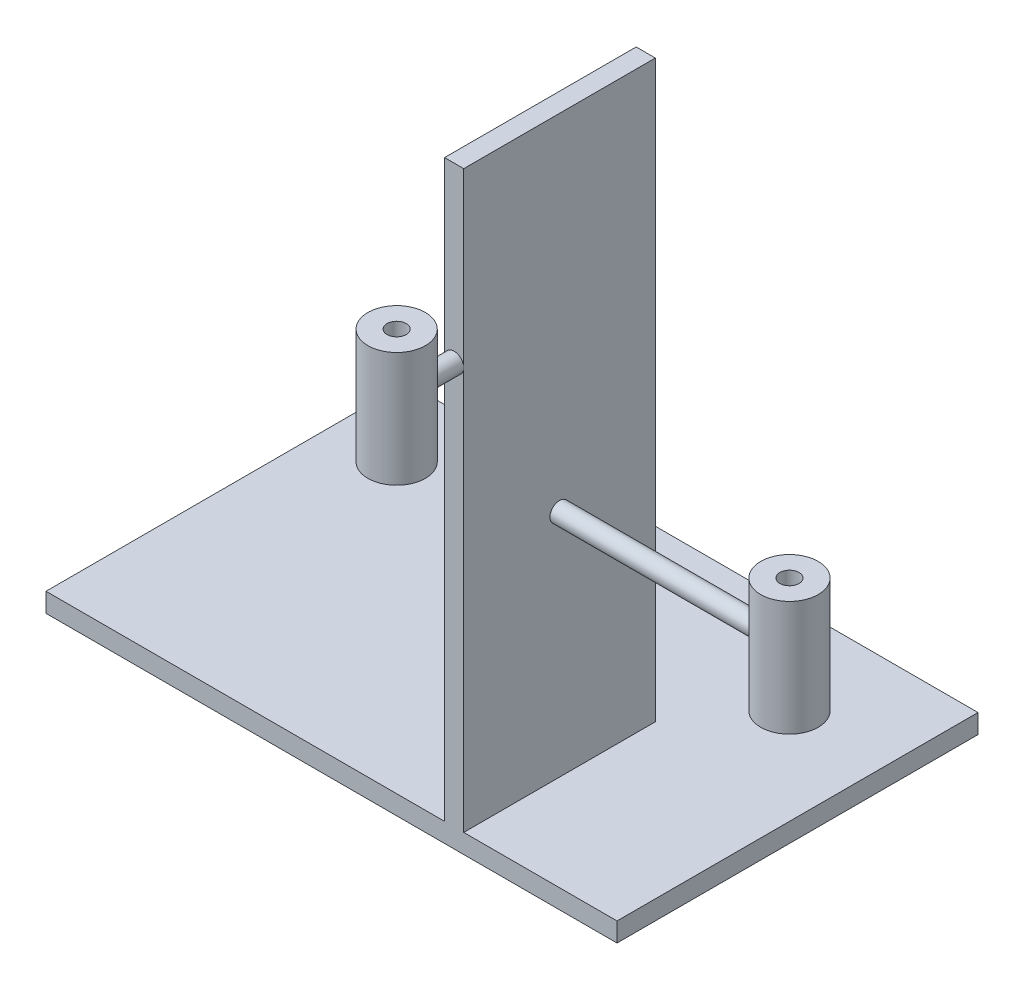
ISO-10303-21;
HEADER;
FILE_DESCRIPTION(('STEP AP214'),'2;1');
FILE_NAME('part.step','',(''),(''),'','','');
FILE_SCHEMA(('AUTOMOTIVE_DESIGN { 1 0 10303 214 1 1 1 1 }'));
ENDSEC;
DATA;
#1=APPLICATION_CONTEXT('core data for automotive mechanical design processes');
#2=APPLICATION_PROTOCOL_DEFINITION('international standard','automotive_design',2000,#1);
#3=PRODUCT_CONTEXT('',#1,'mechanical');
#4=PRODUCT('Part','Part','',(#3));
#5=PRODUCT_RELATED_PRODUCT_CATEGORY('part','',(#4));
#6=PRODUCT_DEFINITION_FORMATION('','',#4);
#7=PRODUCT_DEFINITION_CONTEXT('part definition',#1,'design');
#8=PRODUCT_DEFINITION('design','',#6,#7);
#9=PRODUCT_DEFINITION_SHAPE('','',#8);
#10=(LENGTH_UNIT() NAMED_UNIT(*) SI_UNIT(.MILLI.,.METRE.));
#11=(NAMED_UNIT(*) PLANE_ANGLE_UNIT() SI_UNIT($,.RADIAN.));
#12=(NAMED_UNIT(*) SI_UNIT($,.STERADIAN.) SOLID_ANGLE_UNIT());
#13=UNCERTAINTY_MEASURE_WITH_UNIT(LENGTH_MEASURE(1.E-05),#10,'distance_accuracy_value','');
#14=(GEOMETRIC_REPRESENTATION_CONTEXT(3) GLOBAL_UNCERTAINTY_ASSIGNED_CONTEXT((#13)) GLOBAL_UNIT_ASSIGNED_CONTEXT((#10,
#11,#12)) REPRESENTATION_CONTEXT('',''));
#15=CARTESIAN_POINT('',(0.,0.,0.));
#16=DIRECTION('',(0.,0.,1.));
#17=DIRECTION('',(1.,0.,0.));
#18=AXIS2_PLACEMENT_3D('',#15,#16,#17);
#19=CARTESIAN_POINT('',(-62.5,45.,40.));
#20=DIRECTION('',(0.,0.,-1.));
#21=DIRECTION('',(-1.,0.,0.));
#22=AXIS2_PLACEMENT_3D('',#19,#20,#21);
#23=CYLINDRICAL_SURFACE('',#22,2.5);
#24=CARTESIAN_POINT('',(-62.5,45.,25.));
#25=DIRECTION('',(0.,0.,1.));
#26=DIRECTION('',(1.,0.,0.));
#27=AXIS2_PLACEMENT_3D('',#24,#25,#26);
#28=CIRCLE('',#27,2.5);
#29=CARTESIAN_POINT('',(-60.,45.,25.));
#30=VERTEX_POINT('',#29);
#31=CARTESIAN_POINT('',(-65.,45.,25.));
#32=VERTEX_POINT('',#31);
#33=EDGE_CURVE('E182',#30,#32,#28,.T.);
#34=ORIENTED_EDGE('',*,*,#33,.T.);
#35=EDGE_CURVE('E42',#32,#30,#28,.T.);
#36=ORIENTED_EDGE('',*,*,#35,.T.);
#37=EDGE_LOOP('',(#34,#36));
#38=FACE_BOUND('',#37,.T.);
#39=CARTESIAN_POINT('',(-65.,45.,32.9289321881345));
#40=CARTESIAN_POINT('',(-65.0000006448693,44.8638295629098,32.9289326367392));
#41=CARTESIAN_POINT('',(-64.9888369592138,44.727663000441,32.9249557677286));
#42=CARTESIAN_POINT('',(-64.944627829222,44.4593639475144,32.9095606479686));
#43=CARTESIAN_POINT('',(-64.911578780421,44.3272321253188,32.8981411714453));
#44=CARTESIAN_POINT('',(-64.8248887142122,44.0709327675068,32.8692949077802));
#45=CARTESIAN_POINT('',(-64.7712880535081,43.9467501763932,32.851879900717));
#46=CARTESIAN_POINT('',(-64.6451540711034,43.7090998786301,32.8130219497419));
#47=CARTESIAN_POINT('',(-64.5726165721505,43.5956345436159,32.7915781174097));
#48=CARTESIAN_POINT('',(-64.4076278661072,43.3782000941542,32.7461377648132));
#49=CARTESIAN_POINT('',(-64.3145608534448,43.2747114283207,32.7220776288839));
#50=CARTESIAN_POINT('',(-64.112469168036,43.0844829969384,32.6746533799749));
#51=CARTESIAN_POINT('',(-64.0034419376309,42.9977459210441,32.651289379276));
#52=CARTESIAN_POINT('',(-63.7690112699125,42.841302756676,32.607153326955));
#53=CARTESIAN_POINT('',(-63.6432547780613,42.7721000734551,32.5864648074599));
#54=CARTESIAN_POINT('',(-63.3810780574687,42.6560210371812,32.5507603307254));
#55=CARTESIAN_POINT('',(-63.244660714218,42.6091386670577,32.5357428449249));
#56=CARTESIAN_POINT('',(-62.9700720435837,42.540660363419,32.5135231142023));
#57=CARTESIAN_POINT('',(-62.8321268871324,42.5182413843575,32.506067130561));
#58=CARTESIAN_POINT('',(-62.5542446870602,42.4967092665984,32.4989097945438));
#59=CARTESIAN_POINT('',(-62.4143081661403,42.497590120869,32.4992064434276));
#60=CARTESIAN_POINT('',(-62.1422412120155,42.5221106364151,32.5073490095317));
#61=CARTESIAN_POINT('',(-62.0100198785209,42.5448563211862,32.5148983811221));
#62=CARTESIAN_POINT('',(-61.7513914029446,42.6109824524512,32.5363258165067));
#63=CARTESIAN_POINT('',(-61.624984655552,42.6543642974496,32.5502043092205));
#64=CARTESIAN_POINT('',(-61.3796188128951,42.7610532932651,32.5831082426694));
#65=CARTESIAN_POINT('',(-61.2607794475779,42.8246148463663,32.6021989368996));
#66=CARTESIAN_POINT('',(-61.0351891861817,42.9696492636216,32.643540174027));
#67=CARTESIAN_POINT('',(-60.9284416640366,43.0511271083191,32.6657915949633));
#68=CARTESIAN_POINT('',(-60.7247478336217,43.2341859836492,32.7123452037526));
#69=CARTESIAN_POINT('',(-60.6284996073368,43.3365328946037,32.7366946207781));
#70=CARTESIAN_POINT('',(-60.4543068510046,43.5561218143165,32.7838166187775));
#71=CARTESIAN_POINT('',(-60.3763651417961,43.6733661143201,32.8065889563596));
#72=CARTESIAN_POINT('',(-60.2400313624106,43.9216340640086,32.8482368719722));
#73=CARTESIAN_POINT('',(-60.1819338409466,44.0528303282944,32.8670522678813));
#74=CARTESIAN_POINT('',(-60.0888920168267,44.323928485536,32.8979587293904));
#75=CARTESIAN_POINT('',(-60.0539380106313,44.4638267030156,32.9100526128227));
#76=CARTESIAN_POINT('',(-60.0095967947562,44.7415958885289,32.9255090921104));
#77=CARTESIAN_POINT('',(-59.9991272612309,44.8792735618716,32.9292409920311));
#78=CARTESIAN_POINT('',(-60.0009864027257,45.1544403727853,32.9285831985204));
#79=CARTESIAN_POINT('',(-60.0133109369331,45.29192954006,32.9241949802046));
#80=CARTESIAN_POINT('',(-60.0594358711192,45.5578924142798,32.9081595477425));
#81=CARTESIAN_POINT('',(-60.0924840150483,45.6865135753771,32.896766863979));
#82=CARTESIAN_POINT('',(-60.1782153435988,45.936359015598,32.8682861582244));
#83=CARTESIAN_POINT('',(-60.2309020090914,46.0575819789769,32.851197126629));
#84=CARTESIAN_POINT('',(-60.3563141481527,46.2934510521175,32.8125780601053));
#85=CARTESIAN_POINT('',(-60.4296222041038,46.4077666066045,32.7909243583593));
#86=CARTESIAN_POINT('',(-60.5935359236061,46.6228651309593,32.7458557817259));
#87=CARTESIAN_POINT('',(-60.684146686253,46.723644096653,32.7224403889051));
#88=CARTESIAN_POINT('',(-60.8852707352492,46.9138199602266,32.6751240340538));
#89=CARTESIAN_POINT('',(-60.9965318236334,47.0024359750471,32.6512539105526));
#90=CARTESIAN_POINT('',(-61.2329317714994,47.1597903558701,32.6068287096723));
#91=CARTESIAN_POINT('',(-61.3580701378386,47.2285294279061,32.5862735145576));
#92=CARTESIAN_POINT('',(-61.6180503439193,47.3435502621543,32.5508898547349));
#93=CARTESIAN_POINT('',(-61.752822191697,47.3899781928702,32.5360242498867));
#94=CARTESIAN_POINT('',(-62.028853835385,47.4593193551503,32.5135347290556));
#95=CARTESIAN_POINT('',(-62.1701112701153,47.4822410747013,32.5059081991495));
#96=CARTESIAN_POINT('',(-62.4479616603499,47.5031551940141,32.4989534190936));
#97=CARTESIAN_POINT('',(-62.5844618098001,47.5022686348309,32.499251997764));
#98=CARTESIAN_POINT('',(-62.8552778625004,47.478356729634,32.5071950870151));
#99=CARTESIAN_POINT('',(-62.9895939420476,47.4553331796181,32.5148390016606));
#100=CARTESIAN_POINT('',(-63.2501052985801,47.3885444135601,32.5364771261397));
#101=CARTESIAN_POINT('',(-63.376395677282,47.3451144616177,32.5503685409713));
#102=CARTESIAN_POINT('',(-63.6199458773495,47.2390561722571,32.5830709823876));
#103=CARTESIAN_POINT('',(-63.7372040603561,47.1764243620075,32.6018828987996));
#104=CARTESIAN_POINT('',(-63.964085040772,47.031076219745,32.643353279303));
#105=CARTESIAN_POINT('',(-64.073265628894,46.9477032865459,32.6661281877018));
#106=CARTESIAN_POINT('',(-64.2764525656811,46.7643565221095,32.712675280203));
#107=CARTESIAN_POINT('',(-64.3704540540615,46.6643773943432,32.7364477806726));
#108=CARTESIAN_POINT('',(-64.5443545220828,46.4459766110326,32.7834180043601));
#109=CARTESIAN_POINT('',(-64.6235574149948,46.3269862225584,32.8065568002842));
#110=CARTESIAN_POINT('',(-64.7607858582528,46.076663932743,32.8484951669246));
#111=CARTESIAN_POINT('',(-64.8188169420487,45.9453352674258,32.8672958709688));
#112=CARTESIAN_POINT('',(-64.9096095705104,45.6800954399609,32.8974666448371));
#113=CARTESIAN_POINT('',(-64.9433947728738,45.5465693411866,32.9091341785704));
#114=CARTESIAN_POINT('',(-64.9885858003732,45.2753598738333,32.924865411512));
#115=CARTESIAN_POINT('',(-64.9999993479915,45.1376779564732,32.9289317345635));
#116=CARTESIAN_POINT('',(-65.,45.,32.9289321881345));
#117=B_SPLINE_CURVE_WITH_KNOTS('',3,(#39,#40,#41,#42,#43,#44,#45,#46,#47,#48,#49,#50,#51,#52,
#53,#54,#55,#56,#57,#58,#59,#60,#61,#62,#63,#64,#65,#66,#67,#68,#69,#70,#71,#72,#73,#74,#75,#76,
#77,#78,#79,#80,#81,#82,#83,#84,#85,#86,#87,#88,#89,#90,#91,#92,#93,#94,#95,#96,#97,#98,#99,
#100,#101,#102,#103,#104,#105,#106,#107,#108,#109,#110,#111,#112,#113,#114,#115,#116),
.UNSPECIFIED.,.T.,.F.,(4,2,2,2,2,2,2,2,2,2,2,2,2,2,2,2,2,2,2,2,2,2,2,2,2,2,2,2,2,2,2,2,2,2,2,2,
2,2,4),(0.,0.40800146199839,0.816070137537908,1.22334156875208,1.63070291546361,
2.05253343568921,2.47443162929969,2.90733765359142,3.34012690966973,3.75785796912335,
4.17548133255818,4.57672512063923,4.97799610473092,5.38454137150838,5.79119979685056,
6.21700435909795,6.64287449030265,7.07481599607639,7.5065762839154,7.918857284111,
8.33106339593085,8.72910989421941,9.12722697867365,9.53797144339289,9.9488371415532,
10.3794702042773,10.8100879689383,11.2378447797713,11.6654470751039,12.0729521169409,
12.4804241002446,12.8814239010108,13.2824962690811,13.6983879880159,14.1144126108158,
14.5467225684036,14.9789194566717,15.3915803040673,15.8040986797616),.UNSPECIFIED.);
#118=CARTESIAN_POINT('',(-65.,45.,32.9289321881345));
#119=VERTEX_POINT('',#118);
#120=EDGE_CURVE('E11',#119,#119,#117,.T.);
#121=ORIENTED_EDGE('',*,*,#120,.F.);
#122=EDGE_LOOP('',(#121));
#123=FACE_BOUND('',#122,.T.);
#124=ADVANCED_FACE('F32',(#38,#123),#23,.T.);
#125=CARTESIAN_POINT('',(-65.,90.,25.));
#126=DIRECTION('',(0.,0.,-1.));
#127=DIRECTION('',(0.,1.,0.));
#128=AXIS2_PLACEMENT_3D('',#125,#126,#127);
#129=PLANE('',#128);
#130=ORIENTED_EDGE('',*,*,#33,.F.);
#131=DIRECTION('',(0.,1.,0.));
#132=VECTOR('',#131,1.);
#133=CARTESIAN_POINT('',(-60.,90.,25.));
#134=LINE('',#133,#132);
#135=CARTESIAN_POINT('',(-60.,90.,25.));
#136=VERTEX_POINT('',#135);
#137=EDGE_CURVE('E171',#30,#136,#134,.T.);
#138=ORIENTED_EDGE('',*,*,#137,.T.);
#139=DIRECTION('',(1.,0.,0.));
#140=VECTOR('',#139,1.);
#141=CARTESIAN_POINT('',(-65.,90.,25.));
#142=LINE('',#141,#140);
#143=CARTESIAN_POINT('',(-65.,90.,25.));
#144=VERTEX_POINT('',#143);
#145=EDGE_CURVE('E262',#144,#136,#142,.T.);
#146=ORIENTED_EDGE('',*,*,#145,.F.);
#147=DIRECTION('',(0.,1.,0.));
#148=VECTOR('',#147,1.);
#149=CARTESIAN_POINT('',(-65.,90.,25.));
#150=LINE('',#149,#148);
#151=EDGE_CURVE('E184',#32,#144,#150,.T.);
#152=ORIENTED_EDGE('',*,*,#151,.F.);
#153=EDGE_LOOP('',(#130,#138,#146,#152));
#154=FACE_BOUND('',#153,.T.);
#155=ADVANCED_FACE('F183',(#154),#129,.F.);
#156=ORIENTED_EDGE('',*,*,#35,.F.);
#157=CARTESIAN_POINT('',(-65.,-60.,25.));
#158=VERTEX_POINT('',#157);
#159=EDGE_CURVE('E203',#158,#32,#150,.T.);
#160=ORIENTED_EDGE('',*,*,#159,.F.);
#161=DIRECTION('',(1.,0.,0.));
#162=VECTOR('',#161,1.);
#163=CARTESIAN_POINT('',(-169.,-60.,25.));
#164=LINE('',#163,#162);
#165=CARTESIAN_POINT('',(-169.,-60.,25.));
#166=VERTEX_POINT('',#165);
#167=EDGE_CURVE('E157',#166,#158,#164,.T.);
#168=ORIENTED_EDGE('',*,*,#167,.F.);
#169=DIRECTION('',(0.,-1.,0.));
#170=VECTOR('',#169,1.);
#171=CARTESIAN_POINT('',(-169.,-60.,25.));
#172=LINE('',#171,#170);
#173=CARTESIAN_POINT('',(-169.,-65.,25.));
#174=VERTEX_POINT('',#173);
#175=EDGE_CURVE('E112',#166,#174,#172,.T.);
#176=ORIENTED_EDGE('',*,*,#175,.T.);
#177=DIRECTION('',(1.,0.,0.));
#178=VECTOR('',#177,1.);
#179=CARTESIAN_POINT('',(-169.,-65.,25.));
#180=LINE('',#179,#178);
#181=CARTESIAN_POINT('',(-20.,-65.,25.));
#182=VERTEX_POINT('',#181);
#183=EDGE_CURVE('E105',#174,#182,#180,.T.);
#184=ORIENTED_EDGE('',*,*,#183,.T.);
#185=DIRECTION('',(0.,-1.,0.));
#186=VECTOR('',#185,1.);
#187=CARTESIAN_POINT('',(-20.,-60.,25.));
#188=LINE('',#187,#186);
#189=CARTESIAN_POINT('',(-20.,-60.,25.));
#190=VERTEX_POINT('',#189);
#191=EDGE_CURVE('E110',#190,#182,#188,.T.);
#192=ORIENTED_EDGE('',*,*,#191,.F.);
#193=CARTESIAN_POINT('',(-60.,-60.,25.));
#194=VERTEX_POINT('',#193);
#195=EDGE_CURVE('E154',#194,#190,#164,.T.);
#196=ORIENTED_EDGE('',*,*,#195,.F.);
#197=EDGE_CURVE('E167',#194,#30,#134,.T.);
#198=ORIENTED_EDGE('',*,*,#197,.T.);
#199=EDGE_LOOP('',(#156,#160,#168,#176,#184,#192,#196,#198));
#200=FACE_BOUND('',#199,.T.);
#201=ADVANCED_FACE('F107',(#200),#129,.F.);
#202=CARTESIAN_POINT('',(0.,15.,0.));
#203=DIRECTION('',(0.,-1.,0.));
#204=DIRECTION('',(0.,0.,-1.));
#205=AXIS2_PLACEMENT_3D('',#202,#203,#204);
#206=CYLINDRICAL_SURFACE('',#205,7.5);
#207=CARTESIAN_POINT('',(-7.07106781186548,0.,-2.5));
#208=CARTESIAN_POINT('',(-7.07106736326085,0.13617043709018,-2.50000064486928));
#209=CARTESIAN_POINT('',(-7.07504423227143,0.272336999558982,-2.48883695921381));
#210=CARTESIAN_POINT('',(-7.09043935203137,0.540636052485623,-2.44462782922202));
#211=CARTESIAN_POINT('',(-7.10185882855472,0.672767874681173,-2.41157878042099));
#212=CARTESIAN_POINT('',(-7.13070509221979,0.92906723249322,-2.32488871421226));
#213=CARTESIAN_POINT('',(-7.14812009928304,1.05324982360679,-2.27128805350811));
#214=CARTESIAN_POINT('',(-7.18697805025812,1.2909001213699,-2.14515407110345));
#215=CARTESIAN_POINT('',(-7.20842188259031,1.40436545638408,-2.07261657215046));
#216=CARTESIAN_POINT('',(-7.25386223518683,1.62179990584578,-1.90762786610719));
#217=CARTESIAN_POINT('',(-7.2779223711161,1.72528857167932,-1.8145608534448));
#218=CARTESIAN_POINT('',(-7.32534662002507,1.9155170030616,-1.61246916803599));
#219=CARTESIAN_POINT('',(-7.34871062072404,2.00225407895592,-1.50344193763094));
#220=CARTESIAN_POINT('',(-7.39284667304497,2.15869724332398,-1.26901126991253));
#221=CARTESIAN_POINT('',(-7.41353519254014,2.22789992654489,-1.14325477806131));
#222=CARTESIAN_POINT('',(-7.44923966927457,2.34397896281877,-0.881078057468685));
#223=CARTESIAN_POINT('',(-7.46425715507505,2.39086133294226,-0.74466071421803));
#224=CARTESIAN_POINT('',(-7.48647688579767,2.45933963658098,-0.470072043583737));
#225=CARTESIAN_POINT('',(-7.49393286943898,2.48175861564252,-0.332126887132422));
#226=CARTESIAN_POINT('',(-7.5010902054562,2.50329073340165,-0.0542446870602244));
#227=CARTESIAN_POINT('',(-7.50079355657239,2.50240987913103,0.0856918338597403));
#228=CARTESIAN_POINT('',(-7.49265099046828,2.47788936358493,0.357758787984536));
#229=CARTESIAN_POINT('',(-7.48510161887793,2.45514367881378,0.489980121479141));
#230=CARTESIAN_POINT('',(-7.46367418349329,2.38901754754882,0.748608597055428));
#231=CARTESIAN_POINT('',(-7.44979569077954,2.34563570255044,0.875015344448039));
#232=CARTESIAN_POINT('',(-7.41689175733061,2.23894670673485,1.12038118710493));
#233=CARTESIAN_POINT('',(-7.39780106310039,2.17538515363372,1.23922055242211));
#234=CARTESIAN_POINT('',(-7.35645982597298,2.03035073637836,1.46481081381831));
#235=CARTESIAN_POINT('',(-7.33420840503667,1.94887289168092,1.57155833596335));
#236=CARTESIAN_POINT('',(-7.28765479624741,1.76581401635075,1.77525216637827));
#237=CARTESIAN_POINT('',(-7.26330537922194,1.6634671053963,1.87150039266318));
#238=CARTESIAN_POINT('',(-7.21618338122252,1.44387818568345,2.04569314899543));
#239=CARTESIAN_POINT('',(-7.19341104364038,1.32663388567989,2.12363485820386));
#240=CARTESIAN_POINT('',(-7.15176312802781,1.0783659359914,2.25996863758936));
#241=CARTESIAN_POINT('',(-7.1329477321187,0.947169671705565,2.31806615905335));
#242=CARTESIAN_POINT('',(-7.10204127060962,0.676071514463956,2.41110798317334));
#243=CARTESIAN_POINT('',(-7.08994738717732,0.536173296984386,2.44606198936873));
#244=CARTESIAN_POINT('',(-7.07449090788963,0.258404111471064,2.4904032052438));
#245=CARTESIAN_POINT('',(-7.0707590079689,0.120726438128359,2.50087273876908));
#246=CARTESIAN_POINT('',(-7.07141680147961,-0.154440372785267,2.4990135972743));
#247=CARTESIAN_POINT('',(-7.07580501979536,-0.291929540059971,2.48668906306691));
#248=CARTESIAN_POINT('',(-7.09184045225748,-0.557892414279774,2.44056412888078));
#249=CARTESIAN_POINT('',(-7.10323313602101,-0.686513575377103,2.40751598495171));
#250=CARTESIAN_POINT('',(-7.13171384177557,-0.936359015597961,2.32178465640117));
#251=CARTESIAN_POINT('',(-7.14880287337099,-1.05758197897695,2.26909799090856));
#252=CARTESIAN_POINT('',(-7.18742193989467,-1.29345105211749,2.14368585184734));
#253=CARTESIAN_POINT('',(-7.20907564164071,-1.4077666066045,2.07037779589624));
#254=CARTESIAN_POINT('',(-7.25414421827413,-1.6228651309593,1.9064640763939));
#255=CARTESIAN_POINT('',(-7.27755961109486,-1.72364409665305,1.81585331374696));
#256=CARTESIAN_POINT('',(-7.32487596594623,-1.9138199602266,1.61472926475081));
#257=CARTESIAN_POINT('',(-7.34874608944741,-2.00243597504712,1.50346817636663));
#258=CARTESIAN_POINT('',(-7.39317129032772,-2.15979035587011,1.26706822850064));
#259=CARTESIAN_POINT('',(-7.41372648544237,-2.22852942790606,1.14192986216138));
#260=CARTESIAN_POINT('',(-7.44911014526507,-2.34355026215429,0.881949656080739));
#261=CARTESIAN_POINT('',(-7.46397575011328,-2.38997819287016,0.747177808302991));
#262=CARTESIAN_POINT('',(-7.48646527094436,-2.45931935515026,0.47114616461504));
#263=CARTESIAN_POINT('',(-7.49409180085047,-2.48224107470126,0.329888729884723));
#264=CARTESIAN_POINT('',(-7.50104658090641,-2.50315519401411,0.0520383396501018));
#265=CARTESIAN_POINT('',(-7.50074800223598,-2.50226863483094,-0.0844618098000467));
#266=CARTESIAN_POINT('',(-7.49280491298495,-2.47835672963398,-0.355277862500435));
#267=CARTESIAN_POINT('',(-7.48516099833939,-2.45533317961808,-0.489593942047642));
#268=CARTESIAN_POINT('',(-7.46352287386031,-2.38854441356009,-0.750105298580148));
#269=CARTESIAN_POINT('',(-7.44963145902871,-2.34511446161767,-0.876395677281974));
#270=CARTESIAN_POINT('',(-7.41692901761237,-2.23905617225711,-1.11994587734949));
#271=CARTESIAN_POINT('',(-7.39811710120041,-2.17642436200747,-1.23720406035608));
#272=CARTESIAN_POINT('',(-7.35664672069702,-2.03107621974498,-1.46408504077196));
#273=CARTESIAN_POINT('',(-7.33387181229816,-1.9477032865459,-1.57326562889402));
#274=CARTESIAN_POINT('',(-7.28732471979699,-1.76435652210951,-1.77645256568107));
#275=CARTESIAN_POINT('',(-7.26355221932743,-1.66437739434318,-1.87045405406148));
#276=CARTESIAN_POINT('',(-7.21658199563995,-1.44597661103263,-2.04435452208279));
#277=CARTESIAN_POINT('',(-7.19344319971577,-1.3269862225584,-2.12355741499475));
#278=CARTESIAN_POINT('',(-7.15150483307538,-1.07666393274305,-2.26078585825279));
#279=CARTESIAN_POINT('',(-7.13270412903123,-0.945335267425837,-2.31881694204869));
#280=CARTESIAN_POINT('',(-7.10253335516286,-0.68009543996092,-2.40960957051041));
#281=CARTESIAN_POINT('',(-7.09086582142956,-0.546569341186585,-2.4433947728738));
#282=CARTESIAN_POINT('',(-7.07513458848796,-0.275359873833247,-2.48858580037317));
#283=CARTESIAN_POINT('',(-7.07106826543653,-0.137677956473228,-2.49999934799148));
#284=CARTESIAN_POINT('',(-7.07106781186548,0.,-2.5));
#285=B_SPLINE_CURVE_WITH_KNOTS('',3,(#207,#208,#209,#210,#211,#212,#213,#214,#215,#216,#217,
#218,#219,#220,#221,#222,#223,#224,#225,#226,#227,#228,#229,#230,#231,#232,#233,#234,#235,#236,
#237,#238,#239,#240,#241,#242,#243,#244,#245,#246,#247,#248,#249,#250,#251,#252,#253,#254,#255,
#256,#257,#258,#259,#260,#261,#262,#263,#264,#265,#266,#267,#268,#269,#270,#271,#272,#273,#274,
#275,#276,#277,#278,#279,#280,#281,#282,#283,#284),.UNSPECIFIED.,.T.,.F.,(4,2,2,2,2,2,2,2,2,2,2,
2,2,2,2,2,2,2,2,2,2,2,2,2,2,2,2,2,2,2,2,2,2,2,2,2,2,2,4),(0.,0.40800146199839,0.816070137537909,
1.22334156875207,1.63070291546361,2.0525334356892,2.4744316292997,2.90733765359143,
3.34012690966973,3.75785796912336,4.17548133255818,4.57672512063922,4.97799610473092,
5.38454137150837,5.79119979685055,6.21700435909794,6.64287449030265,7.07481599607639,
7.50657628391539,7.91885728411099,8.33106339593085,8.72910989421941,9.12722697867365,
9.53797144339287,9.94883714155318,10.3794702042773,10.8100879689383,11.2378447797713,
11.6654470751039,12.0729521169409,12.4804241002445,12.8814239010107,13.2824962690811,
13.6983879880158,14.1144126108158,14.5467225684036,14.9789194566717,15.3915803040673,
15.8040986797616),.UNSPECIFIED.);
#286=CARTESIAN_POINT('',(-7.07106781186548,0.,-2.5));
#287=VERTEX_POINT('',#286);
#288=EDGE_CURVE('E245',#287,#287,#285,.T.);
#289=ORIENTED_EDGE('',*,*,#288,.T.);
#290=EDGE_LOOP('',(#289));
#291=FACE_BOUND('',#290,.T.);
#292=CARTESIAN_POINT('',(0.,15.,0.));
#293=DIRECTION('',(0.,1.,0.));
#294=DIRECTION('',(0.,0.,1.));
#295=AXIS2_PLACEMENT_3D('',#292,#293,#294);
#296=CIRCLE('',#295,7.5);
#297=CARTESIAN_POINT('',(0.,15.,7.5));
#298=VERTEX_POINT('',#297);
#299=EDGE_CURVE('E191',#298,#298,#296,.T.);
#300=ORIENTED_EDGE('',*,*,#299,.F.);
#301=EDGE_LOOP('',(#300));
#302=FACE_BOUND('',#301,.T.);
#303=CARTESIAN_POINT('',(0.,-15.,0.));
#304=DIRECTION('',(0.,1.,0.));
#305=DIRECTION('',(0.,0.,1.));
#306=AXIS2_PLACEMENT_3D('',#303,#304,#305);
#307=CIRCLE('',#306,7.5);
#308=CARTESIAN_POINT('',(0.,-15.,7.5));
#309=VERTEX_POINT('',#308);
#310=EDGE_CURVE('E193',#309,#309,#307,.T.);
#311=ORIENTED_EDGE('',*,*,#310,.T.);
#312=EDGE_LOOP('',(#311));
#313=FACE_BOUND('',#312,.T.);
#314=ADVANCED_FACE('F34',(#291,#302,#313),#206,.T.);
#315=CARTESIAN_POINT('',(0.,15.,0.));
#316=DIRECTION('',(0.,1.,0.));
#317=DIRECTION('',(0.,0.,1.));
#318=AXIS2_PLACEMENT_3D('',#315,#316,#317);
#319=PLANE('',#318);
#320=CARTESIAN_POINT('',(0.,15.,0.));
#321=DIRECTION('',(0.,1.,0.));
#322=DIRECTION('',(0.,0.,1.));
#323=AXIS2_PLACEMENT_3D('',#320,#321,#322);
#324=CIRCLE('',#323,2.5);
#325=CARTESIAN_POINT('',(0.,15.,2.5));
#326=VERTEX_POINT('',#325);
#327=EDGE_CURVE('E131',#326,#326,#324,.T.);
#328=ORIENTED_EDGE('',*,*,#327,.F.);
#329=EDGE_LOOP('',(#328));
#330=FACE_BOUND('',#329,.T.);
#331=ORIENTED_EDGE('',*,*,#299,.T.);
#332=EDGE_LOOP('',(#331));
#333=FACE_BOUND('',#332,.T.);
#334=ADVANCED_FACE('F289',(#330,#333),#319,.T.);
#335=CARTESIAN_POINT('',(0.,-15.,0.));
#336=DIRECTION('',(0.,1.,0.));
#337=DIRECTION('',(0.,0.,1.));
#338=AXIS2_PLACEMENT_3D('',#335,#336,#337);
#339=PLANE('',#338);
#340=CARTESIAN_POINT('',(0.,-15.,0.));
#341=DIRECTION('',(0.,1.,0.));
#342=DIRECTION('',(0.,0.,1.));
#343=AXIS2_PLACEMENT_3D('',#340,#341,#342);
#344=CIRCLE('',#343,2.5);
#345=CARTESIAN_POINT('',(0.,-15.,2.5));
#346=VERTEX_POINT('',#345);
#347=EDGE_CURVE('E134',#346,#346,#344,.T.);
#348=ORIENTED_EDGE('',*,*,#347,.T.);
#349=EDGE_LOOP('',(#348));
#350=FACE_BOUND('',#349,.T.);
#351=ORIENTED_EDGE('',*,*,#310,.F.);
#352=EDGE_LOOP('',(#351));
#353=FACE_BOUND('',#352,.T.);
#354=ADVANCED_FACE('F280',(#350,#353),#339,.F.);
#355=CARTESIAN_POINT('',(-60.,0.,0.));
#356=DIRECTION('',(1.,0.,0.));
#357=DIRECTION('',(0.,0.,-1.));
#358=AXIS2_PLACEMENT_3D('',#355,#356,#357);
#359=CYLINDRICAL_SURFACE('',#358,2.5);
#360=CARTESIAN_POINT('',(-60.,0.,0.));
#361=DIRECTION('',(-1.,0.,0.));
#362=DIRECTION('',(0.,0.,1.));
#363=AXIS2_PLACEMENT_3D('',#360,#361,#362);
#364=CIRCLE('',#363,2.5);
#365=CARTESIAN_POINT('',(-60.,0.,2.5));
#366=VERTEX_POINT('',#365);
#367=EDGE_CURVE('E266',#366,#366,#364,.F.);
#368=ORIENTED_EDGE('',*,*,#367,.T.);
#369=EDGE_LOOP('',(#368));
#370=FACE_BOUND('',#369,.T.);
#371=ORIENTED_EDGE('',*,*,#288,.F.);
#372=EDGE_LOOP('',(#371));
#373=FACE_BOUND('',#372,.T.);
#374=ADVANCED_FACE('F277',(#370,#373),#359,.T.);
#375=CARTESIAN_POINT('',(-65.,90.,-25.));
#376=DIRECTION('',(0.,0.,1.));
#377=DIRECTION('',(0.,-1.,0.));
#378=AXIS2_PLACEMENT_3D('',#375,#376,#377);
#379=PLANE('',#378);
#380=DIRECTION('',(0.,-1.,0.));
#381=VECTOR('',#380,1.);
#382=CARTESIAN_POINT('',(-60.,90.,-25.));
#383=LINE('',#382,#381);
#384=CARTESIAN_POINT('',(-60.,90.,-25.));
#385=VERTEX_POINT('',#384);
#386=CARTESIAN_POINT('',(-60.,-60.,-25.));
#387=VERTEX_POINT('',#386);
#388=EDGE_CURVE('E187',#385,#387,#383,.T.);
#389=ORIENTED_EDGE('',*,*,#388,.T.);
#390=DIRECTION('',(1.,0.,0.));
#391=VECTOR('',#390,1.);
#392=CARTESIAN_POINT('',(-65.,-60.,-25.));
#393=LINE('',#392,#391);
#394=CARTESIAN_POINT('',(-65.,-60.,-25.));
#395=VERTEX_POINT('',#394);
#396=EDGE_CURVE('E264',#395,#387,#393,.T.);
#397=ORIENTED_EDGE('',*,*,#396,.F.);
#398=DIRECTION('',(0.,-1.,0.));
#399=VECTOR('',#398,1.);
#400=CARTESIAN_POINT('',(-65.,90.,-25.));
#401=LINE('',#400,#399);
#402=CARTESIAN_POINT('',(-65.,90.,-25.));
#403=VERTEX_POINT('',#402);
#404=EDGE_CURVE('E250',#403,#395,#401,.T.);
#405=ORIENTED_EDGE('',*,*,#404,.F.);
#406=DIRECTION('',(1.,0.,0.));
#407=VECTOR('',#406,1.);
#408=CARTESIAN_POINT('',(-65.,90.,-25.));
#409=LINE('',#408,#407);
#410=EDGE_CURVE('E259',#403,#385,#409,.T.);
#411=ORIENTED_EDGE('',*,*,#410,.T.);
#412=EDGE_LOOP('',(#389,#397,#405,#411));
#413=FACE_BOUND('',#412,.T.);
#414=ADVANCED_FACE('F279',(#413),#379,.F.);
#415=CARTESIAN_POINT('',(-65.,90.,-25.));
#416=DIRECTION('',(0.,-1.,0.));
#417=DIRECTION('',(0.,0.,-1.));
#418=AXIS2_PLACEMENT_3D('',#415,#416,#417);
#419=PLANE('',#418);
#420=DIRECTION('',(0.,0.,-1.));
#421=VECTOR('',#420,1.);
#422=CARTESIAN_POINT('',(-60.,90.,-25.));
#423=LINE('',#422,#421);
#424=EDGE_CURVE('E170',#136,#385,#423,.T.);
#425=ORIENTED_EDGE('',*,*,#424,.T.);
#426=ORIENTED_EDGE('',*,*,#410,.F.);
#427=DIRECTION('',(0.,0.,-1.));
#428=VECTOR('',#427,1.);
#429=CARTESIAN_POINT('',(-65.,90.,-25.));
#430=LINE('',#429,#428);
#431=EDGE_CURVE('E57',#144,#403,#430,.T.);
#432=ORIENTED_EDGE('',*,*,#431,.F.);
#433=ORIENTED_EDGE('',*,*,#145,.T.);
#434=EDGE_LOOP('',(#425,#426,#432,#433));
#435=FACE_BOUND('',#434,.T.);
#436=ADVANCED_FACE('F286',(#435),#419,.F.);
#437=CARTESIAN_POINT('',(-65.,-60.,-25.));
#438=DIRECTION('',(-1.,0.,0.));
#439=DIRECTION('',(0.,0.,1.));
#440=AXIS2_PLACEMENT_3D('',#437,#438,#439);
#441=PLANE('',#440);
#442=ORIENTED_EDGE('',*,*,#404,.T.);
#443=DIRECTION('',(0.,0.,1.));
#444=VECTOR('',#443,1.);
#445=CARTESIAN_POINT('',(-65.,-60.,-25.));
#446=LINE('',#445,#444);
#447=EDGE_CURVE('E249',#395,#158,#446,.T.);
#448=ORIENTED_EDGE('',*,*,#447,.T.);
#449=ORIENTED_EDGE('',*,*,#159,.T.);
#450=ORIENTED_EDGE('',*,*,#151,.T.);
#451=ORIENTED_EDGE('',*,*,#431,.T.);
#452=EDGE_LOOP('',(#442,#448,#449,#450,#451));
#453=FACE_BOUND('',#452,.T.);
#454=ADVANCED_FACE('F308',(#453),#441,.T.);
#455=CARTESIAN_POINT('',(-60.,-60.,-25.));
#456=DIRECTION('',(-1.,0.,0.));
#457=DIRECTION('',(0.,0.,1.));
#458=AXIS2_PLACEMENT_3D('',#455,#456,#457);
#459=PLANE('',#458);
#460=ORIENTED_EDGE('',*,*,#367,.F.);
#461=EDGE_LOOP('',(#460));
#462=FACE_BOUND('',#461,.T.);
#463=ORIENTED_EDGE('',*,*,#388,.F.);
#464=ORIENTED_EDGE('',*,*,#424,.F.);
#465=ORIENTED_EDGE('',*,*,#137,.F.);
#466=ORIENTED_EDGE('',*,*,#197,.F.);
#467=DIRECTION('',(0.,0.,1.));
#468=VECTOR('',#467,1.);
#469=CARTESIAN_POINT('',(-60.,-60.,-25.));
#470=LINE('',#469,#468);
#471=EDGE_CURVE('E166',#387,#194,#470,.T.);
#472=ORIENTED_EDGE('',*,*,#471,.F.);
#473=EDGE_LOOP('',(#463,#464,#465,#466,#472));
#474=FACE_BOUND('',#473,.T.);
#475=ADVANCED_FACE('F176',(#462,#474),#459,.F.);
#476=CARTESIAN_POINT('',(-62.5,60.,40.));
#477=DIRECTION('',(0.,-1.,0.));
#478=DIRECTION('',(0.,0.,-1.));
#479=AXIS2_PLACEMENT_3D('',#476,#477,#478);
#480=CYLINDRICAL_SURFACE('',#479,7.5);
#481=CARTESIAN_POINT('',(-62.5,30.,40.));
#482=DIRECTION('',(0.,1.,0.));
#483=DIRECTION('',(0.,0.,1.));
#484=AXIS2_PLACEMENT_3D('',#481,#482,#483);
#485=CIRCLE('',#484,7.5);
#486=CARTESIAN_POINT('',(-62.5,30.,47.5));
#487=VERTEX_POINT('',#486);
#488=EDGE_CURVE('E159',#487,#487,#485,.T.);
#489=ORIENTED_EDGE('',*,*,#488,.T.);
#490=EDGE_LOOP('',(#489));
#491=FACE_BOUND('',#490,.T.);
#492=CARTESIAN_POINT('',(-62.5,60.,40.));
#493=DIRECTION('',(0.,1.,0.));
#494=DIRECTION('',(0.,0.,1.));
#495=AXIS2_PLACEMENT_3D('',#492,#493,#494);
#496=CIRCLE('',#495,7.5);
#497=CARTESIAN_POINT('',(-62.5,60.,47.5));
#498=VERTEX_POINT('',#497);
#499=EDGE_CURVE('E188',#498,#498,#496,.T.);
#500=ORIENTED_EDGE('',*,*,#499,.F.);
#501=EDGE_LOOP('',(#500));
#502=FACE_BOUND('',#501,.T.);
#503=ORIENTED_EDGE('',*,*,#120,.T.);
#504=EDGE_LOOP('',(#503));
#505=FACE_BOUND('',#504,.T.);
#506=ADVANCED_FACE('F237',(#491,#502,#505),#480,.T.);
#507=CARTESIAN_POINT('',(-62.5,60.,40.));
#508=DIRECTION('',(0.,1.,0.));
#509=DIRECTION('',(0.,0.,1.));
#510=AXIS2_PLACEMENT_3D('',#507,#508,#509);
#511=PLANE('',#510);
#512=CARTESIAN_POINT('',(-62.5,60.,40.));
#513=DIRECTION('',(0.,1.,0.));
#514=DIRECTION('',(0.,0.,1.));
#515=AXIS2_PLACEMENT_3D('',#512,#513,#514);
#516=CIRCLE('',#515,2.5);
#517=CARTESIAN_POINT('',(-62.5,60.,42.5));
#518=VERTEX_POINT('',#517);
#519=EDGE_CURVE('E207',#518,#518,#516,.T.);
#520=ORIENTED_EDGE('',*,*,#519,.F.);
#521=EDGE_LOOP('',(#520));
#522=FACE_BOUND('',#521,.T.);
#523=ORIENTED_EDGE('',*,*,#499,.T.);
#524=EDGE_LOOP('',(#523));
#525=FACE_BOUND('',#524,.T.);
#526=ADVANCED_FACE('F318',(#522,#525),#511,.T.);
#527=CARTESIAN_POINT('',(-62.5,30.,40.));
#528=DIRECTION('',(0.,1.,0.));
#529=DIRECTION('',(0.,0.,1.));
#530=AXIS2_PLACEMENT_3D('',#527,#528,#529);
#531=PLANE('',#530);
#532=CARTESIAN_POINT('',(-62.5,30.,40.));
#533=DIRECTION('',(0.,1.,0.));
#534=DIRECTION('',(0.,0.,1.));
#535=AXIS2_PLACEMENT_3D('',#532,#533,#534);
#536=CIRCLE('',#535,2.5);
#537=CARTESIAN_POINT('',(-62.5,30.,42.5));
#538=VERTEX_POINT('',#537);
#539=EDGE_CURVE('E37',#538,#538,#536,.T.);
#540=ORIENTED_EDGE('',*,*,#539,.T.);
#541=EDGE_LOOP('',(#540));
#542=FACE_BOUND('',#541,.T.);
#543=ORIENTED_EDGE('',*,*,#488,.F.);
#544=EDGE_LOOP('',(#543));
#545=FACE_BOUND('',#544,.T.);
#546=ADVANCED_FACE('F216',(#542,#545),#531,.F.);
#547=CARTESIAN_POINT('',(-169.,-60.,25.));
#548=DIRECTION('',(0.,1.,0.));
#549=DIRECTION('',(0.,0.,1.));
#550=AXIS2_PLACEMENT_3D('',#547,#548,#549);
#551=PLANE('',#550);
#552=ORIENTED_EDGE('',*,*,#396,.T.);
#553=ORIENTED_EDGE('',*,*,#471,.T.);
#554=ORIENTED_EDGE('',*,*,#195,.T.);
#555=DIRECTION('',(0.,0.,1.));
#556=VECTOR('',#555,1.);
#557=CARTESIAN_POINT('',(-20.,-60.,25.));
#558=LINE('',#557,#556);
#559=CARTESIAN_POINT('',(-20.,-60.,-69.1942899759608));
#560=VERTEX_POINT('',#559);
#561=EDGE_CURVE('E130',#560,#190,#558,.T.);
#562=ORIENTED_EDGE('',*,*,#561,.F.);
#563=DIRECTION('',(1.,0.,0.));
#564=VECTOR('',#563,1.);
#565=CARTESIAN_POINT('',(-169.,-60.,-69.1942899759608));
#566=LINE('',#565,#564);
#567=CARTESIAN_POINT('',(-169.,-60.,-69.1942899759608));
#568=VERTEX_POINT('',#567);
#569=EDGE_CURVE('E150',#568,#560,#566,.T.);
#570=ORIENTED_EDGE('',*,*,#569,.F.);
#571=DIRECTION('',(0.,0.,1.));
#572=VECTOR('',#571,1.);
#573=CARTESIAN_POINT('',(-169.,-60.,25.));
#574=LINE('',#573,#572);
#575=EDGE_CURVE('E117',#568,#166,#574,.T.);
#576=ORIENTED_EDGE('',*,*,#575,.T.);
#577=ORIENTED_EDGE('',*,*,#167,.T.);
#578=ORIENTED_EDGE('',*,*,#447,.F.);
#579=EDGE_LOOP('',(#552,#553,#554,#562,#570,#576,#577,#578));
#580=FACE_BOUND('',#579,.T.);
#581=ADVANCED_FACE('F164',(#580),#551,.T.);
#582=CARTESIAN_POINT('',(-169.,-60.,-69.1942899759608));
#583=DIRECTION('',(0.,0.,-1.));
#584=DIRECTION('',(-1.,0.,0.));
#585=AXIS2_PLACEMENT_3D('',#582,#583,#584);
#586=PLANE('',#585);
#587=ORIENTED_EDGE('',*,*,#569,.T.);
#588=DIRECTION('',(0.,1.,0.));
#589=VECTOR('',#588,1.);
#590=CARTESIAN_POINT('',(-20.,-60.,-69.1942899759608));
#591=LINE('',#590,#589);
#592=CARTESIAN_POINT('',(-20.,-65.,-69.1942899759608));
#593=VERTEX_POINT('',#592);
#594=EDGE_CURVE('E125',#593,#560,#591,.T.);
#595=ORIENTED_EDGE('',*,*,#594,.F.);
#596=DIRECTION('',(1.,0.,0.));
#597=VECTOR('',#596,1.);
#598=CARTESIAN_POINT('',(-169.,-65.,-69.1942899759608));
#599=LINE('',#598,#597);
#600=CARTESIAN_POINT('',(-169.,-65.,-69.1942899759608));
#601=VERTEX_POINT('',#600);
#602=EDGE_CURVE('E116',#601,#593,#599,.T.);
#603=ORIENTED_EDGE('',*,*,#602,.F.);
#604=DIRECTION('',(0.,1.,0.));
#605=VECTOR('',#604,1.);
#606=CARTESIAN_POINT('',(-169.,-60.,-69.1942899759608));
#607=LINE('',#606,#605);
#608=EDGE_CURVE('E143',#601,#568,#607,.T.);
#609=ORIENTED_EDGE('',*,*,#608,.T.);
#610=EDGE_LOOP('',(#587,#595,#603,#609));
#611=FACE_BOUND('',#610,.T.);
#612=ADVANCED_FACE('F338',(#611),#586,.T.);
#613=CARTESIAN_POINT('',(-169.,-65.,25.));
#614=DIRECTION('',(0.,-1.,0.));
#615=DIRECTION('',(0.,0.,-1.));
#616=AXIS2_PLACEMENT_3D('',#613,#614,#615);
#617=PLANE('',#616);
#618=ORIENTED_EDGE('',*,*,#602,.T.);
#619=DIRECTION('',(0.,0.,-1.));
#620=VECTOR('',#619,1.);
#621=CARTESIAN_POINT('',(-20.,-65.,25.));
#622=LINE('',#621,#620);
#623=EDGE_CURVE('E120',#182,#593,#622,.T.);
#624=ORIENTED_EDGE('',*,*,#623,.F.);
#625=ORIENTED_EDGE('',*,*,#183,.F.);
#626=DIRECTION('',(0.,0.,-1.));
#627=VECTOR('',#626,1.);
#628=CARTESIAN_POINT('',(-169.,-65.,25.));
#629=LINE('',#628,#627);
#630=EDGE_CURVE('E141',#174,#601,#629,.T.);
#631=ORIENTED_EDGE('',*,*,#630,.T.);
#632=EDGE_LOOP('',(#618,#624,#625,#631));
#633=FACE_BOUND('',#632,.T.);
#634=ADVANCED_FACE('F121',(#633),#617,.T.);
#635=CARTESIAN_POINT('',(-169.,-65.,25.));
#636=DIRECTION('',(1.,0.,0.));
#637=DIRECTION('',(0.,0.,-1.));
#638=AXIS2_PLACEMENT_3D('',#635,#636,#637);
#639=PLANE('',#638);
#640=ORIENTED_EDGE('',*,*,#175,.F.);
#641=ORIENTED_EDGE('',*,*,#575,.F.);
#642=ORIENTED_EDGE('',*,*,#608,.F.);
#643=ORIENTED_EDGE('',*,*,#630,.F.);
#644=EDGE_LOOP('',(#640,#641,#642,#643));
#645=FACE_BOUND('',#644,.T.);
#646=ADVANCED_FACE('F343',(#645),#639,.F.);
#647=CARTESIAN_POINT('',(-20.,-65.,25.));
#648=DIRECTION('',(1.,0.,0.));
#649=DIRECTION('',(0.,0.,-1.));
#650=AXIS2_PLACEMENT_3D('',#647,#648,#649);
#651=PLANE('',#650);
#652=ORIENTED_EDGE('',*,*,#191,.T.);
#653=ORIENTED_EDGE('',*,*,#623,.T.);
#654=ORIENTED_EDGE('',*,*,#594,.T.);
#655=ORIENTED_EDGE('',*,*,#561,.T.);
#656=EDGE_LOOP('',(#652,#653,#654,#655));
#657=FACE_BOUND('',#656,.T.);
#658=ADVANCED_FACE('F128',(#657),#651,.T.);
#659=CARTESIAN_POINT('',(0.,-20.986379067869,0.));
#660=DIRECTION('',(0.,1.,0.));
#661=DIRECTION('',(0.,0.,1.));
#662=AXIS2_PLACEMENT_3D('',#659,#660,#661);
#663=CYLINDRICAL_SURFACE('',#662,2.5);
#664=ORIENTED_EDGE('',*,*,#327,.T.);
#665=EDGE_LOOP('',(#664));
#666=FACE_BOUND('',#665,.T.);
#667=ORIENTED_EDGE('',*,*,#347,.F.);
#668=EDGE_LOOP('',(#667));
#669=FACE_BOUND('',#668,.T.);
#670=ADVANCED_FACE('F221',(#666,#669),#663,.F.);
#671=CARTESIAN_POINT('',(-62.5,-20.986379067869,40.));
#672=DIRECTION('',(0.,1.,0.));
#673=DIRECTION('',(0.,0.,1.));
#674=AXIS2_PLACEMENT_3D('',#671,#672,#673);
#675=CYLINDRICAL_SURFACE('',#674,2.5);
#676=ORIENTED_EDGE('',*,*,#519,.T.);
#677=EDGE_LOOP('',(#676));
#678=FACE_BOUND('',#677,.T.);
#679=ORIENTED_EDGE('',*,*,#539,.F.);
#680=EDGE_LOOP('',(#679));
#681=FACE_BOUND('',#680,.T.);
#682=ADVANCED_FACE('F219',(#678,#681),#675,.F.);
#683=CLOSED_SHELL('',(#124,#155,#201,#314,#334,#354,#374,#414,#436,#454,#475,#506,#526,#546,
#581,#612,#634,#646,#658,#670,#682));
#684=MANIFOLD_SOLID_BREP('B2',#683);
#685=ADVANCED_BREP_SHAPE_REPRESENTATION('',(#18,#684),#14);
#686=SHAPE_DEFINITION_REPRESENTATION(#9,#685);
ENDSEC;
END-ISO-10303-21;
